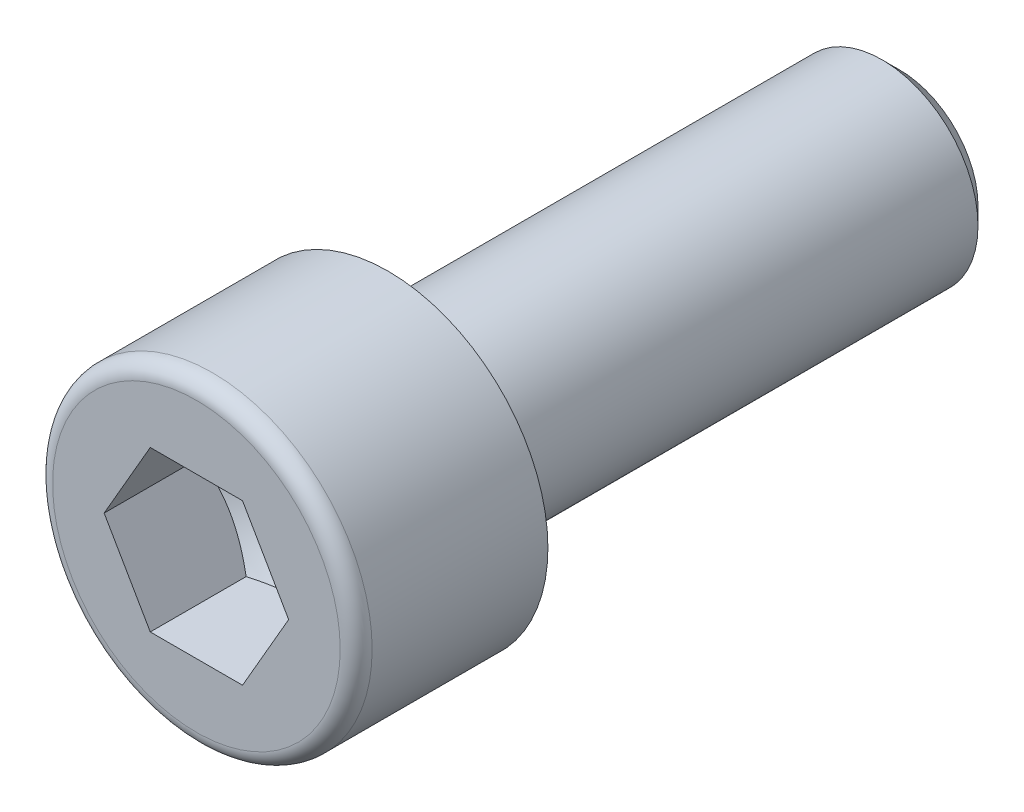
ISO-10303-21;
HEADER;
FILE_DESCRIPTION(('STEP AP214'),'2;1');
FILE_NAME('part.step','',(''),(''),'','','');
FILE_SCHEMA(('AUTOMOTIVE_DESIGN { 1 0 10303 214 1 1 1 1 }'));
ENDSEC;
DATA;
#1=APPLICATION_CONTEXT('core data for automotive mechanical design processes');
#2=APPLICATION_PROTOCOL_DEFINITION('international standard','automotive_design',2000,#1);
#3=PRODUCT_CONTEXT('',#1,'mechanical');
#4=PRODUCT('Part','Part','',(#3));
#5=PRODUCT_RELATED_PRODUCT_CATEGORY('part','',(#4));
#6=PRODUCT_DEFINITION_FORMATION('','',#4);
#7=PRODUCT_DEFINITION_CONTEXT('part definition',#1,'design');
#8=PRODUCT_DEFINITION('design','',#6,#7);
#9=PRODUCT_DEFINITION_SHAPE('','',#8);
#10=(LENGTH_UNIT() NAMED_UNIT(*) SI_UNIT(.MILLI.,.METRE.));
#11=(NAMED_UNIT(*) PLANE_ANGLE_UNIT() SI_UNIT($,.RADIAN.));
#12=(NAMED_UNIT(*) SI_UNIT($,.STERADIAN.) SOLID_ANGLE_UNIT());
#13=UNCERTAINTY_MEASURE_WITH_UNIT(LENGTH_MEASURE(1.E-05),#10,'distance_accuracy_value','');
#14=(GEOMETRIC_REPRESENTATION_CONTEXT(3) GLOBAL_UNCERTAINTY_ASSIGNED_CONTEXT((#13)) GLOBAL_UNIT_ASSIGNED_CONTEXT((#10,
#11,#12)) REPRESENTATION_CONTEXT('',''));
#15=CARTESIAN_POINT('',(0.,0.,0.));
#16=DIRECTION('',(0.,0.,1.));
#17=DIRECTION('',(1.,0.,0.));
#18=AXIS2_PLACEMENT_3D('',#15,#16,#17);
#19=CARTESIAN_POINT('',(0.,0.,6.00000000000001));
#20=DIRECTION('',(0.,0.,0.999999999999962));
#21=DIRECTION('',(0.999999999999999,0.,0.));
#22=AXIS2_PLACEMENT_3D('',#19,#20,#21);
#23=PLANE('',#22);
#24=CARTESIAN_POINT('',(0.,0.,6.00000000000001));
#25=DIRECTION('',(0.,0.,0.999999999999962));
#26=DIRECTION('',(0.999999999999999,0.,0.));
#27=AXIS2_PLACEMENT_3D('',#24,#25,#26);
#28=CIRCLE('',#27,4.5);
#29=CARTESIAN_POINT('',(4.50000000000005,0.,6.00000000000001));
#30=VERTEX_POINT('',#29);
#31=EDGE_CURVE('E11',#30,#30,#28,.T.);
#32=ORIENTED_EDGE('',*,*,#31,.T.);
#33=EDGE_LOOP('',(#32));
#34=FACE_BOUND('',#33,.T.);
#35=DIRECTION('',(1.,0.,0.));
#36=VECTOR('',#35,1.);
#37=CARTESIAN_POINT('',(-1.44337499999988,2.49999883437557,5.99999999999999));
#38=LINE('',#37,#36);
#39=CARTESIAN_POINT('',(-1.44337499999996,2.49999883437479,5.99999999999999));
#40=VERTEX_POINT('',#39);
#41=CARTESIAN_POINT('',(1.44337500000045,2.49999883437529,6.00000000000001));
#42=VERTEX_POINT('',#41);
#43=EDGE_CURVE('E92',#40,#42,#38,.T.);
#44=ORIENTED_EDGE('',*,*,#43,.T.);
#45=DIRECTION('',(0.5,-0.866025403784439,0.));
#46=VECTOR('',#45,1.);
#47=CARTESIAN_POINT('',(1.44337500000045,2.49999883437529,6.00000000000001));
#48=LINE('',#47,#46);
#49=CARTESIAN_POINT('',(2.88675000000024,6.66133814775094E-13,6.00000000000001));
#50=VERTEX_POINT('',#49);
#51=EDGE_CURVE('E31',#42,#50,#48,.T.);
#52=ORIENTED_EDGE('',*,*,#51,.T.);
#53=DIRECTION('',(-0.499999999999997,-0.86602540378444,0.));
#54=VECTOR('',#53,1.);
#55=CARTESIAN_POINT('',(2.88675000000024,6.66133814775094E-13,6.00000000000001));
#56=LINE('',#55,#54);
#57=CARTESIAN_POINT('',(1.44337500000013,-2.49999883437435,6.00000000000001));
#58=VERTEX_POINT('',#57);
#59=EDGE_CURVE('E169',#50,#58,#56,.T.);
#60=ORIENTED_EDGE('',*,*,#59,.T.);
#61=DIRECTION('',(-1.,0.,0.));
#62=VECTOR('',#61,1.);
#63=CARTESIAN_POINT('',(1.44337500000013,-2.49999883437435,6.00000000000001));
#64=LINE('',#63,#62);
#65=CARTESIAN_POINT('',(-1.44337499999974,-2.49999883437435,6.00000000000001));
#66=VERTEX_POINT('',#65);
#67=EDGE_CURVE('E165',#58,#66,#64,.T.);
#68=ORIENTED_EDGE('',*,*,#67,.T.);
#69=DIRECTION('',(-0.5,0.866025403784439,0.));
#70=VECTOR('',#69,1.);
#71=CARTESIAN_POINT('',(-1.44337499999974,-2.49999883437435,6.00000000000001));
#72=LINE('',#71,#70);
#73=CARTESIAN_POINT('',(-2.88674999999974,5.27355936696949E-13,5.99999999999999));
#74=VERTEX_POINT('',#73);
#75=EDGE_CURVE('E160',#66,#74,#72,.T.);
#76=ORIENTED_EDGE('',*,*,#75,.T.);
#77=DIRECTION('',(0.499999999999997,0.86602540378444,0.));
#78=VECTOR('',#77,1.);
#79=CARTESIAN_POINT('',(-2.88674999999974,5.27355936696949E-13,5.99999999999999));
#80=LINE('',#79,#78);
#81=EDGE_CURVE('E96',#74,#40,#80,.T.);
#82=ORIENTED_EDGE('',*,*,#81,.T.);
#83=EDGE_LOOP('',(#44,#52,#60,#68,#76,#82));
#84=FACE_BOUND('',#83,.T.);
#85=ADVANCED_FACE('F17',(#34,#84),#23,.T.);
#86=CARTESIAN_POINT('',(0.,0.,5.50000000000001));
#87=DIRECTION('',(0.,0.,0.999999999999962));
#88=DIRECTION('',(0.999999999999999,0.,0.));
#89=AXIS2_PLACEMENT_3D('',#86,#87,#88);
#90=TOROIDAL_SURFACE('',#89,4.5,0.5);
#91=ORIENTED_EDGE('',*,*,#31,.F.);
#92=EDGE_LOOP('',(#91));
#93=FACE_BOUND('',#92,.T.);
#94=CARTESIAN_POINT('',(0.,0.,5.50000000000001));
#95=DIRECTION('',(0.,0.,0.999999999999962));
#96=DIRECTION('',(0.999999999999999,0.,0.));
#97=AXIS2_PLACEMENT_3D('',#94,#95,#96);
#98=CIRCLE('',#97,5.);
#99=CARTESIAN_POINT('',(5.00000000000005,0.,5.50000000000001));
#100=VERTEX_POINT('',#99);
#101=EDGE_CURVE('E24',#100,#100,#98,.T.);
#102=ORIENTED_EDGE('',*,*,#101,.T.);
#103=EDGE_LOOP('',(#102));
#104=FACE_BOUND('',#103,.T.);
#105=ADVANCED_FACE('F133',(#93,#104),#90,.T.);
#106=CARTESIAN_POINT('',(0.,0.,6.00000000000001));
#107=DIRECTION('',(0.,0.,0.999999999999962));
#108=DIRECTION('',(0.999999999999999,0.,0.));
#109=AXIS2_PLACEMENT_3D('',#106,#107,#108);
#110=CYLINDRICAL_SURFACE('',#109,5.);
#111=CARTESIAN_POINT('',(0.,0.,0.));
#112=DIRECTION('',(0.,0.,0.999999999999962));
#113=DIRECTION('',(0.999999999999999,0.,0.));
#114=AXIS2_PLACEMENT_3D('',#111,#112,#113);
#115=CIRCLE('',#114,5.);
#116=CARTESIAN_POINT('',(5.00000000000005,0.,0.));
#117=VERTEX_POINT('',#116);
#118=EDGE_CURVE('E128',#117,#117,#115,.T.);
#119=CARTESIAN_POINT('',(5.00000000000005,0.,0.));
#120=CARTESIAN_POINT('',(5.00000000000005,0.,0.057291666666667));
#121=CARTESIAN_POINT('',(5.00000000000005,0.,0.114583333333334));
#122=CARTESIAN_POINT('',(5.00000000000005,0.,0.229166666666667));
#123=CARTESIAN_POINT('',(5.00000000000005,0.,0.286458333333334));
#124=CARTESIAN_POINT('',(5.00000000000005,0.,0.401041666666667));
#125=CARTESIAN_POINT('',(5.00000000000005,0.,0.458333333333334));
#126=CARTESIAN_POINT('',(5.00000000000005,0.,0.572916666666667));
#127=CARTESIAN_POINT('',(5.00000000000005,0.,0.630208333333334));
#128=CARTESIAN_POINT('',(5.00000000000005,0.,0.744791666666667));
#129=CARTESIAN_POINT('',(5.00000000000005,0.,0.802083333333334));
#130=CARTESIAN_POINT('',(5.00000000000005,0.,0.916666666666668));
#131=CARTESIAN_POINT('',(5.00000000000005,0.,0.973958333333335));
#132=CARTESIAN_POINT('',(5.00000000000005,0.,1.08854166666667));
#133=CARTESIAN_POINT('',(5.00000000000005,0.,1.14583333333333));
#134=CARTESIAN_POINT('',(5.00000000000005,0.,1.26041666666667));
#135=CARTESIAN_POINT('',(5.00000000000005,0.,1.31770833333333));
#136=CARTESIAN_POINT('',(5.00000000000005,0.,1.43229166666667));
#137=CARTESIAN_POINT('',(5.00000000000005,0.,1.48958333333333));
#138=CARTESIAN_POINT('',(5.00000000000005,0.,1.60416666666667));
#139=CARTESIAN_POINT('',(5.00000000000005,0.,1.66145833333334));
#140=CARTESIAN_POINT('',(5.00000000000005,0.,1.77604166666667));
#141=CARTESIAN_POINT('',(5.00000000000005,0.,1.83333333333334));
#142=CARTESIAN_POINT('',(5.00000000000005,0.,1.94791666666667));
#143=CARTESIAN_POINT('',(5.00000000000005,0.,2.00520833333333));
#144=CARTESIAN_POINT('',(5.00000000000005,0.,2.11979166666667));
#145=CARTESIAN_POINT('',(5.00000000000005,0.,2.17708333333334));
#146=CARTESIAN_POINT('',(5.00000000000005,0.,2.29166666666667));
#147=CARTESIAN_POINT('',(5.00000000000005,0.,2.34895833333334));
#148=CARTESIAN_POINT('',(5.00000000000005,0.,2.46354166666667));
#149=CARTESIAN_POINT('',(5.00000000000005,0.,2.52083333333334));
#150=CARTESIAN_POINT('',(5.00000000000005,0.,2.63541666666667));
#151=CARTESIAN_POINT('',(5.00000000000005,0.,2.69270833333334));
#152=CARTESIAN_POINT('',(5.00000000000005,0.,2.80729166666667));
#153=CARTESIAN_POINT('',(5.00000000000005,0.,2.86458333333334));
#154=CARTESIAN_POINT('',(5.00000000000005,0.,2.97916666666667));
#155=CARTESIAN_POINT('',(5.00000000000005,0.,3.03645833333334));
#156=CARTESIAN_POINT('',(5.00000000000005,0.,3.15104166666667));
#157=CARTESIAN_POINT('',(5.00000000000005,0.,3.20833333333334));
#158=CARTESIAN_POINT('',(5.00000000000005,0.,3.32291666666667));
#159=CARTESIAN_POINT('',(5.00000000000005,0.,3.38020833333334));
#160=CARTESIAN_POINT('',(5.00000000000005,0.,3.49479166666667));
#161=CARTESIAN_POINT('',(5.00000000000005,0.,3.55208333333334));
#162=CARTESIAN_POINT('',(5.00000000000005,0.,3.66666666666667));
#163=CARTESIAN_POINT('',(5.00000000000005,0.,3.72395833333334));
#164=CARTESIAN_POINT('',(5.00000000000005,0.,3.83854166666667));
#165=CARTESIAN_POINT('',(5.00000000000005,0.,3.89583333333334));
#166=CARTESIAN_POINT('',(5.00000000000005,0.,4.01041666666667));
#167=CARTESIAN_POINT('',(5.00000000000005,0.,4.06770833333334));
#168=CARTESIAN_POINT('',(5.00000000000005,0.,4.18229166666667));
#169=CARTESIAN_POINT('',(5.00000000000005,0.,4.23958333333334));
#170=CARTESIAN_POINT('',(5.00000000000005,0.,4.35416666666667));
#171=CARTESIAN_POINT('',(5.00000000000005,0.,4.41145833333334));
#172=CARTESIAN_POINT('',(5.00000000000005,0.,4.52604166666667));
#173=CARTESIAN_POINT('',(5.00000000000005,0.,4.58333333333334));
#174=CARTESIAN_POINT('',(5.00000000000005,0.,4.69791666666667));
#175=CARTESIAN_POINT('',(5.00000000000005,0.,4.75520833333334));
#176=CARTESIAN_POINT('',(5.00000000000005,0.,4.86979166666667));
#177=CARTESIAN_POINT('',(5.00000000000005,0.,4.92708333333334));
#178=CARTESIAN_POINT('',(5.00000000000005,0.,5.04166666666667));
#179=CARTESIAN_POINT('',(5.00000000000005,0.,5.09895833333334));
#180=CARTESIAN_POINT('',(5.00000000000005,0.,5.21354166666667));
#181=CARTESIAN_POINT('',(5.00000000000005,0.,5.27083333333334));
#182=CARTESIAN_POINT('',(5.00000000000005,0.,5.38541666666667));
#183=CARTESIAN_POINT('',(5.00000000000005,0.,5.44270833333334));
#184=CARTESIAN_POINT('',(5.00000000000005,0.,5.50000000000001));
#185=B_SPLINE_CURVE_WITH_KNOTS('',3,(#119,#120,#121,#122,#123,#124,#125,#126,#127,#128,#129,
#130,#131,#132,#133,#134,#135,#136,#137,#138,#139,#140,#141,#142,#143,#144,#145,#146,#147,#148,
#149,#150,#151,#152,#153,#154,#155,#156,#157,#158,#159,#160,#161,#162,#163,#164,#165,#166,#167,
#168,#169,#170,#171,#172,#173,#174,#175,#176,#177,#178,#179,#180,#181,#182,#183,#184),
.UNSPECIFIED.,.F.,.F.,(4,2,2,2,2,2,2,2,2,2,2,2,2,2,2,2,2,2,2,2,2,2,2,2,2,2,2,2,2,2,2,2,4),(0.,
0.171875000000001,0.34375,0.515625,0.687500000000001,0.859375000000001,1.03125,1.203125,1.375,
1.546875,1.71875,1.890625,2.0625,2.234375,2.40625,2.578125,2.75,2.921875,3.09375,3.265625,
3.4375,3.609375,3.78125,3.953125,4.125,4.296875,4.46875,4.640625,4.8125,4.984375,5.15625,
5.328125,5.50000000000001),.UNSPECIFIED.);
#186=EDGE_CURVE('BSEAM135',#117,#100,#185,.T.);
#187=ORIENTED_EDGE('',*,*,#118,.T.);
#188=ORIENTED_EDGE('',*,*,#101,.F.);
#189=ORIENTED_EDGE('',*,*,#186,.T.);
#190=ORIENTED_EDGE('',*,*,#186,.F.);
#191=EDGE_LOOP('',(#187,#189,#188,#190));
#192=FACE_BOUND('',#191,.T.);
#193=ADVANCED_FACE('F135',(#192),#110,.T.);
#194=CARTESIAN_POINT('',(0.,5.,0.));
#195=DIRECTION('',(0.,0.,-0.999999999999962));
#196=DIRECTION('',(-0.999999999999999,0.,0.));
#197=AXIS2_PLACEMENT_3D('',#194,#195,#196);
#198=PLANE('',#197);
#199=CARTESIAN_POINT('',(0.,0.,0.));
#200=DIRECTION('',(0.,0.,0.999999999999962));
#201=DIRECTION('',(0.999999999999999,0.,0.));
#202=AXIS2_PLACEMENT_3D('',#199,#200,#201);
#203=CIRCLE('',#202,3.3);
#204=CARTESIAN_POINT('',(3.29999999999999,0.,0.));
#205=VERTEX_POINT('',#204);
#206=EDGE_CURVE('E125',#205,#205,#203,.T.);
#207=ORIENTED_EDGE('',*,*,#206,.T.);
#208=EDGE_LOOP('',(#207));
#209=FACE_BOUND('',#208,.T.);
#210=ORIENTED_EDGE('',*,*,#118,.F.);
#211=EDGE_LOOP('',(#210));
#212=FACE_BOUND('',#211,.T.);
#213=ADVANCED_FACE('F137',(#209,#212),#198,.T.);
#214=CARTESIAN_POINT('',(0.,0.,-0.300000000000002));
#215=DIRECTION('',(0.,0.,0.999999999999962));
#216=DIRECTION('',(0.999999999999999,0.,0.));
#217=AXIS2_PLACEMENT_3D('',#214,#215,#216);
#218=TOROIDAL_SURFACE('',#217,3.3,0.3);
#219=CARTESIAN_POINT('',(0.,0.,-0.300000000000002));
#220=DIRECTION('',(0.,0.,0.999999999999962));
#221=DIRECTION('',(0.999999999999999,0.,0.));
#222=AXIS2_PLACEMENT_3D('',#219,#220,#221);
#223=CIRCLE('',#222,3.);
#224=CARTESIAN_POINT('',(3.00000000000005,0.,-0.300000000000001));
#225=VERTEX_POINT('',#224);
#226=EDGE_CURVE('E122',#225,#225,#223,.T.);
#227=ORIENTED_EDGE('',*,*,#226,.T.);
#228=EDGE_LOOP('',(#227));
#229=FACE_BOUND('',#228,.T.);
#230=ORIENTED_EDGE('',*,*,#206,.F.);
#231=EDGE_LOOP('',(#230));
#232=FACE_BOUND('',#231,.T.);
#233=ADVANCED_FACE('F145',(#229,#232),#218,.F.);
#234=CARTESIAN_POINT('',(0.,0.,6.00000000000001));
#235=DIRECTION('',(0.,0.,0.999999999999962));
#236=DIRECTION('',(0.999999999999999,0.,0.));
#237=AXIS2_PLACEMENT_3D('',#234,#235,#236);
#238=CYLINDRICAL_SURFACE('',#237,3.);
#239=CARTESIAN_POINT('',(0.,0.,-0.301000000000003));
#240=DIRECTION('',(0.,0.,0.999999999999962));
#241=DIRECTION('',(0.999999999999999,0.,0.));
#242=AXIS2_PLACEMENT_3D('',#239,#240,#241);
#243=CIRCLE('',#242,3.);
#244=CARTESIAN_POINT('',(3.00000000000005,0.,-0.301000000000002));
#245=VERTEX_POINT('',#244);
#246=EDGE_CURVE('E119',#245,#245,#243,.T.);
#247=CARTESIAN_POINT('',(3.00000000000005,0.,-0.301000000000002));
#248=CARTESIAN_POINT('',(3.00000000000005,0.,-0.300989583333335));
#249=CARTESIAN_POINT('',(3.00000000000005,0.,-0.300979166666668));
#250=CARTESIAN_POINT('',(3.00000000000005,0.,-0.300958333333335));
#251=CARTESIAN_POINT('',(3.00000000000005,0.,-0.300947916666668));
#252=CARTESIAN_POINT('',(3.00000000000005,0.,-0.300927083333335));
#253=CARTESIAN_POINT('',(3.00000000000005,0.,-0.300916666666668));
#254=CARTESIAN_POINT('',(3.00000000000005,0.,-0.300895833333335));
#255=CARTESIAN_POINT('',(3.00000000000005,0.,-0.300885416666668));
#256=CARTESIAN_POINT('',(3.00000000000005,0.,-0.300864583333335));
#257=CARTESIAN_POINT('',(3.00000000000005,0.,-0.300854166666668));
#258=CARTESIAN_POINT('',(3.00000000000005,0.,-0.300833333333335));
#259=CARTESIAN_POINT('',(3.00000000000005,0.,-0.300822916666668));
#260=CARTESIAN_POINT('',(3.00000000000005,0.,-0.300802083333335));
#261=CARTESIAN_POINT('',(3.00000000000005,0.,-0.300791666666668));
#262=CARTESIAN_POINT('',(3.00000000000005,0.,-0.300770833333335));
#263=CARTESIAN_POINT('',(3.00000000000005,0.,-0.300760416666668));
#264=CARTESIAN_POINT('',(3.00000000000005,0.,-0.300739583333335));
#265=CARTESIAN_POINT('',(3.00000000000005,0.,-0.300729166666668));
#266=CARTESIAN_POINT('',(3.00000000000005,0.,-0.300708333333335));
#267=CARTESIAN_POINT('',(3.00000000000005,0.,-0.300697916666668));
#268=CARTESIAN_POINT('',(3.00000000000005,0.,-0.300677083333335));
#269=CARTESIAN_POINT('',(3.00000000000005,0.,-0.300666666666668));
#270=CARTESIAN_POINT('',(3.00000000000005,0.,-0.300645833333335));
#271=CARTESIAN_POINT('',(3.00000000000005,0.,-0.300635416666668));
#272=CARTESIAN_POINT('',(3.00000000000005,0.,-0.300614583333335));
#273=CARTESIAN_POINT('',(3.00000000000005,0.,-0.300604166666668));
#274=CARTESIAN_POINT('',(3.00000000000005,0.,-0.300583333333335));
#275=CARTESIAN_POINT('',(3.00000000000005,0.,-0.300572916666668));
#276=CARTESIAN_POINT('',(3.00000000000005,0.,-0.300552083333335));
#277=CARTESIAN_POINT('',(3.00000000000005,0.,-0.300541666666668));
#278=CARTESIAN_POINT('',(3.00000000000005,0.,-0.300520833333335));
#279=CARTESIAN_POINT('',(3.00000000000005,0.,-0.300510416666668));
#280=CARTESIAN_POINT('',(3.00000000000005,0.,-0.300489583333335));
#281=CARTESIAN_POINT('',(3.00000000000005,0.,-0.300479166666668));
#282=CARTESIAN_POINT('',(3.00000000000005,0.,-0.300458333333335));
#283=CARTESIAN_POINT('',(3.00000000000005,0.,-0.300447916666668));
#284=CARTESIAN_POINT('',(3.00000000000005,0.,-0.300427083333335));
#285=CARTESIAN_POINT('',(3.00000000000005,0.,-0.300416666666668));
#286=CARTESIAN_POINT('',(3.00000000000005,0.,-0.300395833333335));
#287=CARTESIAN_POINT('',(3.00000000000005,0.,-0.300385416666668));
#288=CARTESIAN_POINT('',(3.00000000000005,0.,-0.300364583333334));
#289=CARTESIAN_POINT('',(3.00000000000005,0.,-0.300354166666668));
#290=CARTESIAN_POINT('',(3.00000000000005,0.,-0.300333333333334));
#291=CARTESIAN_POINT('',(3.00000000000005,0.,-0.300322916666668));
#292=CARTESIAN_POINT('',(3.00000000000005,0.,-0.300302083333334));
#293=CARTESIAN_POINT('',(3.00000000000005,0.,-0.300291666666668));
#294=CARTESIAN_POINT('',(3.00000000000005,0.,-0.300270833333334));
#295=CARTESIAN_POINT('',(3.00000000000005,0.,-0.300260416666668));
#296=CARTESIAN_POINT('',(3.00000000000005,0.,-0.300239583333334));
#297=CARTESIAN_POINT('',(3.00000000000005,0.,-0.300229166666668));
#298=CARTESIAN_POINT('',(3.00000000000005,0.,-0.300208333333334));
#299=CARTESIAN_POINT('',(3.00000000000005,0.,-0.300197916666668));
#300=CARTESIAN_POINT('',(3.00000000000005,0.,-0.300177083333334));
#301=CARTESIAN_POINT('',(3.00000000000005,0.,-0.300166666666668));
#302=CARTESIAN_POINT('',(3.00000000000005,0.,-0.300145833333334));
#303=CARTESIAN_POINT('',(3.00000000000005,0.,-0.300135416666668));
#304=CARTESIAN_POINT('',(3.00000000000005,0.,-0.300114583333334));
#305=CARTESIAN_POINT('',(3.00000000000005,0.,-0.300104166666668));
#306=CARTESIAN_POINT('',(3.00000000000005,0.,-0.300083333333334));
#307=CARTESIAN_POINT('',(3.00000000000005,0.,-0.300072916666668));
#308=CARTESIAN_POINT('',(3.00000000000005,0.,-0.300052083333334));
#309=CARTESIAN_POINT('',(3.00000000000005,0.,-0.300041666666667));
#310=CARTESIAN_POINT('',(3.00000000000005,0.,-0.300020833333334));
#311=CARTESIAN_POINT('',(3.00000000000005,0.,-0.300010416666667));
#312=CARTESIAN_POINT('',(3.00000000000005,0.,-0.300000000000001));
#313=B_SPLINE_CURVE_WITH_KNOTS('',3,(#247,#248,#249,#250,#251,#252,#253,#254,#255,#256,#257,
#258,#259,#260,#261,#262,#263,#264,#265,#266,#267,#268,#269,#270,#271,#272,#273,#274,#275,#276,
#277,#278,#279,#280,#281,#282,#283,#284,#285,#286,#287,#288,#289,#290,#291,#292,#293,#294,#295,
#296,#297,#298,#299,#300,#301,#302,#303,#304,#305,#306,#307,#308,#309,#310,#311,#312),
.UNSPECIFIED.,.F.,.F.,(4,2,2,2,2,2,2,2,2,2,2,2,2,2,2,2,2,2,2,2,2,2,2,2,2,2,2,2,2,2,2,2,4),(0.,
3.12500000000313E-05,6.25000000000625E-05,9.37500000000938E-05,0.000125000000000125,
0.000156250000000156,0.000187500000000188,0.000218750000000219,0.00025000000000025,
0.000281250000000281,0.000312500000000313,0.000343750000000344,0.000375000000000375,
0.000406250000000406,0.000437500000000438,0.000468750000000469,0.0005000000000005,
0.000531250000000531,0.000562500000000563,0.000593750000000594,0.000625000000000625,
0.000656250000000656,0.000687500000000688,0.000718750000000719,0.00075000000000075,
0.000781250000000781,0.000812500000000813,0.000843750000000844,0.000875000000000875,
0.000906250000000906,0.000937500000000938,0.000968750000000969,0.001000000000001),.UNSPECIFIED.);
#314=EDGE_CURVE('BSEAM268',#245,#225,#313,.T.);
#315=ORIENTED_EDGE('',*,*,#246,.T.);
#316=ORIENTED_EDGE('',*,*,#226,.F.);
#317=ORIENTED_EDGE('',*,*,#314,.T.);
#318=ORIENTED_EDGE('',*,*,#314,.F.);
#319=EDGE_LOOP('',(#315,#317,#316,#318));
#320=FACE_BOUND('',#319,.T.);
#321=ADVANCED_FACE('F268',(#320),#238,.T.);
#322=CARTESIAN_POINT('',(0.,0.,-0.301000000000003));
#323=DIRECTION('',(0.,0.,0.999999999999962));
#324=DIRECTION('',(0.999999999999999,0.,0.));
#325=AXIS2_PLACEMENT_3D('',#322,#323,#324);
#326=CONICAL_SURFACE('',#325,3.,0.523598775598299);
#327=CARTESIAN_POINT('',(1.45716771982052E-13,2.16493489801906E-12,-1.23847249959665));
#328=DIRECTION('',(0.,0.,0.999999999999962));
#329=DIRECTION('',(0.999999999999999,0.,0.));
#330=AXIS2_PLACEMENT_3D('',#327,#328,#329);
#331=CIRCLE('',#330,2.45875);
#332=CARTESIAN_POINT('',(2.45874999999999,0.,-1.23847249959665));
#333=VERTEX_POINT('',#332);
#334=EDGE_CURVE('E116',#333,#333,#331,.T.);
#335=CARTESIAN_POINT('',(2.45874999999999,0.,-1.23847249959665));
#336=CARTESIAN_POINT('',(2.46438802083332,0.,-1.22870716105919));
#337=CARTESIAN_POINT('',(2.47002604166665,0.,-1.21894182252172));
#338=CARTESIAN_POINT('',(2.48130208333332,0.,-1.19941114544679));
#339=CARTESIAN_POINT('',(2.48694010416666,0.,-1.18964580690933));
#340=CARTESIAN_POINT('',(2.49821614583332,0.,-1.1701151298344));
#341=CARTESIAN_POINT('',(2.50385416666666,0.,-1.16034979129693));
#342=CARTESIAN_POINT('',(2.51513020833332,0.,-1.140819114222));
#343=CARTESIAN_POINT('',(2.52076822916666,0.,-1.13105377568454));
#344=CARTESIAN_POINT('',(2.53204427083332,0.,-1.11152309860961));
#345=CARTESIAN_POINT('',(2.53768229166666,0.,-1.10175776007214));
#346=CARTESIAN_POINT('',(2.54895833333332,0.,-1.08222708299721));
#347=CARTESIAN_POINT('',(2.55459635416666,0.,-1.07246174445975));
#348=CARTESIAN_POINT('',(2.56587239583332,0.,-1.05293106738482));
#349=CARTESIAN_POINT('',(2.57151041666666,0.,-1.04316572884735));
#350=CARTESIAN_POINT('',(2.58278645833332,0.,-1.02363505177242));
#351=CARTESIAN_POINT('',(2.58842447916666,0.,-1.01386971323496));
#352=CARTESIAN_POINT('',(2.59970052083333,0.,-0.994339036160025));
#353=CARTESIAN_POINT('',(2.60533854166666,0.,-0.98457369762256));
#354=CARTESIAN_POINT('',(2.61661458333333,0.,-0.96504302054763));
#355=CARTESIAN_POINT('',(2.62225260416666,0.,-0.955277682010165));
#356=CARTESIAN_POINT('',(2.63352864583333,0.,-0.935747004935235));
#357=CARTESIAN_POINT('',(2.63916666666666,0.,-0.925981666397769));
#358=CARTESIAN_POINT('',(2.65044270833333,0.,-0.906450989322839));
#359=CARTESIAN_POINT('',(2.65608072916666,0.,-0.896685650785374));
#360=CARTESIAN_POINT('',(2.66735677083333,0.,-0.877154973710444));
#361=CARTESIAN_POINT('',(2.67299479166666,0.,-0.867389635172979));
#362=CARTESIAN_POINT('',(2.68427083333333,0.,-0.847858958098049));
#363=CARTESIAN_POINT('',(2.68990885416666,0.,-0.838093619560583));
#364=CARTESIAN_POINT('',(2.70118489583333,0.,-0.818562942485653));
#365=CARTESIAN_POINT('',(2.70682291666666,0.,-0.808797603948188));
#366=CARTESIAN_POINT('',(2.71809895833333,0.,-0.789266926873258));
#367=CARTESIAN_POINT('',(2.72373697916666,0.,-0.779501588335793));
#368=CARTESIAN_POINT('',(2.73501302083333,0.,-0.759970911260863));
#369=CARTESIAN_POINT('',(2.74065104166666,0.,-0.750205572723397));
#370=CARTESIAN_POINT('',(2.75192708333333,0.,-0.730674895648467));
#371=CARTESIAN_POINT('',(2.75756510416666,0.,-0.720909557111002));
#372=CARTESIAN_POINT('',(2.76884114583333,0.,-0.701378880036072));
#373=CARTESIAN_POINT('',(2.77447916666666,0.,-0.691613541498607));
#374=CARTESIAN_POINT('',(2.78575520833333,0.,-0.672082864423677));
#375=CARTESIAN_POINT('',(2.79139322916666,0.,-0.662317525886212));
#376=CARTESIAN_POINT('',(2.80266927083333,0.,-0.642786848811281));
#377=CARTESIAN_POINT('',(2.80830729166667,0.,-0.633021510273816));
#378=CARTESIAN_POINT('',(2.81958333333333,0.,-0.613490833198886));
#379=CARTESIAN_POINT('',(2.82522135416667,0.,-0.603725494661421));
#380=CARTESIAN_POINT('',(2.83649739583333,0.,-0.584194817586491));
#381=CARTESIAN_POINT('',(2.84213541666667,0.,-0.574429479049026));
#382=CARTESIAN_POINT('',(2.85341145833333,0.,-0.554898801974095));
#383=CARTESIAN_POINT('',(2.85904947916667,0.,-0.54513346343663));
#384=CARTESIAN_POINT('',(2.87032552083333,0.,-0.5256027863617));
#385=CARTESIAN_POINT('',(2.87596354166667,0.,-0.515837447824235));
#386=CARTESIAN_POINT('',(2.88723958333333,0.,-0.496306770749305));
#387=CARTESIAN_POINT('',(2.89287760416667,0.,-0.486541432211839));
#388=CARTESIAN_POINT('',(2.90415364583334,0.,-0.467010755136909));
#389=CARTESIAN_POINT('',(2.90979166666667,0.,-0.457245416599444));
#390=CARTESIAN_POINT('',(2.92106770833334,0.,-0.437714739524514));
#391=CARTESIAN_POINT('',(2.92670572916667,0.,-0.427949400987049));
#392=CARTESIAN_POINT('',(2.93798177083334,0.,-0.408418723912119));
#393=CARTESIAN_POINT('',(2.94361979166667,0.,-0.398653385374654));
#394=CARTESIAN_POINT('',(2.95489583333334,0.,-0.379122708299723));
#395=CARTESIAN_POINT('',(2.96053385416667,0.,-0.369357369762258));
#396=CARTESIAN_POINT('',(2.97180989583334,0.,-0.349826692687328));
#397=CARTESIAN_POINT('',(2.97744791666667,0.,-0.340061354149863));
#398=CARTESIAN_POINT('',(2.98872395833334,0.,-0.320530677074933));
#399=CARTESIAN_POINT('',(2.99436197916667,0.,-0.310765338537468));
#400=CARTESIAN_POINT('',(3.,0.,-0.301000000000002));
#401=B_SPLINE_CURVE_WITH_KNOTS('',3,(#335,#336,#337,#338,#339,#340,#341,#342,#343,#344,#345,
#346,#347,#348,#349,#350,#351,#352,#353,#354,#355,#356,#357,#358,#359,#360,#361,#362,#363,#364,
#365,#366,#367,#368,#369,#370,#371,#372,#373,#374,#375,#376,#377,#378,#379,#380,#381,#382,#383,
#384,#385,#386,#387,#388,#389,#390,#391,#392,#393,#394,#395,#396,#397,#398,#399,#400),
.UNSPECIFIED.,.F.,.F.,(4,2,2,2,2,2,2,2,2,2,2,2,2,2,2,2,2,2,2,2,2,2,2,2,2,2,2,2,2,2,2,2,4),(0.,
0.033828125,0.0676562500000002,0.101484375,0.135312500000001,0.169140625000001,
0.202968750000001,0.236796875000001,0.270625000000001,0.304453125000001,0.338281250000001,
0.372109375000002,0.405937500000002,0.439765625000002,0.473593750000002,0.507421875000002,
0.541250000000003,0.575078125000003,0.608906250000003,0.642734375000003,0.676562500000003,
0.710390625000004,0.744218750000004,0.778046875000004,0.811875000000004,0.845703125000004,
0.879531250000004,0.913359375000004,0.947187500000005,0.981015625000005,1.01484375,1.048671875,
1.08250000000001),.UNSPECIFIED.);
#402=EDGE_CURVE('BSEAM264',#333,#245,#401,.T.);
#403=ORIENTED_EDGE('',*,*,#334,.T.);
#404=ORIENTED_EDGE('',*,*,#246,.F.);
#405=ORIENTED_EDGE('',*,*,#402,.T.);
#406=ORIENTED_EDGE('',*,*,#402,.F.);
#407=EDGE_LOOP('',(#403,#405,#404,#406));
#408=FACE_BOUND('',#407,.T.);
#409=ADVANCED_FACE('F264',(#408),#326,.T.);
#410=CARTESIAN_POINT('',(4.78783679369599E-13,2.45875000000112,-1.23847249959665));
#411=DIRECTION('',(0.,0.,0.999999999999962));
#412=DIRECTION('',(0.999999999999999,0.,0.));
#413=AXIS2_PLACEMENT_3D('',#410,#411,#412);
#414=PLANE('',#413);
#415=CARTESIAN_POINT('',(1.45716771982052E-13,2.16493489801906E-12,-1.23847249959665));
#416=DIRECTION('',(0.,0.,0.999999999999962));
#417=DIRECTION('',(0.999999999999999,0.,0.));
#418=AXIS2_PLACEMENT_3D('',#415,#416,#417);
#419=CIRCLE('',#418,3.);
#420=CARTESIAN_POINT('',(3.00000000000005,0.,-1.23847249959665));
#421=VERTEX_POINT('',#420);
#422=EDGE_CURVE('E113',#421,#421,#419,.T.);
#423=ORIENTED_EDGE('',*,*,#422,.T.);
#424=EDGE_LOOP('',(#423));
#425=FACE_BOUND('',#424,.T.);
#426=ORIENTED_EDGE('',*,*,#334,.F.);
#427=EDGE_LOOP('',(#426));
#428=FACE_BOUND('',#427,.T.);
#429=ADVANCED_FACE('F260',(#425,#428),#414,.T.);
#430=CARTESIAN_POINT('',(0.,0.,6.00000000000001));
#431=DIRECTION('',(0.,0.,0.999999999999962));
#432=DIRECTION('',(0.999999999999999,0.,0.));
#433=AXIS2_PLACEMENT_3D('',#430,#431,#432);
#434=CYLINDRICAL_SURFACE('',#433,3.);
#435=CARTESIAN_POINT('',(0.,1.66533453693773E-13,-15.45875));
#436=DIRECTION('',(0.,0.,0.999999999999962));
#437=DIRECTION('',(0.999999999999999,0.,0.));
#438=AXIS2_PLACEMENT_3D('',#435,#436,#437);
#439=CIRCLE('',#438,3.);
#440=CARTESIAN_POINT('',(3.00000000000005,0.,-15.45875));
#441=VERTEX_POINT('',#440);
#442=EDGE_CURVE('E110',#441,#441,#439,.T.);
#443=CARTESIAN_POINT('',(3.00000000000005,0.,-15.45875));
#444=CARTESIAN_POINT('',(3.00000000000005,0.,-15.3106221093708));
#445=CARTESIAN_POINT('',(3.00000000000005,0.,-15.1624942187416));
#446=CARTESIAN_POINT('',(3.00000000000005,0.,-14.8662384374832));
#447=CARTESIAN_POINT('',(3.00000000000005,0.,-14.718110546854));
#448=CARTESIAN_POINT('',(3.00000000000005,0.,-14.4218547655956));
#449=CARTESIAN_POINT('',(3.00000000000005,0.,-14.2737268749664));
#450=CARTESIAN_POINT('',(3.00000000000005,0.,-13.977471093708));
#451=CARTESIAN_POINT('',(3.00000000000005,0.,-13.8293432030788));
#452=CARTESIAN_POINT('',(3.00000000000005,0.,-13.5330874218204));
#453=CARTESIAN_POINT('',(3.00000000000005,0.,-13.3849595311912));
#454=CARTESIAN_POINT('',(3.00000000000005,0.,-13.0887037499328));
#455=CARTESIAN_POINT('',(3.00000000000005,0.,-12.9405758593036));
#456=CARTESIAN_POINT('',(3.00000000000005,0.,-12.6443200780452));
#457=CARTESIAN_POINT('',(3.00000000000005,0.,-12.496192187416));
#458=CARTESIAN_POINT('',(3.00000000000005,0.,-12.1999364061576));
#459=CARTESIAN_POINT('',(3.00000000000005,0.,-12.0518085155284));
#460=CARTESIAN_POINT('',(3.00000000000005,0.,-11.75555273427));
#461=CARTESIAN_POINT('',(3.00000000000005,0.,-11.6074248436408));
#462=CARTESIAN_POINT('',(3.00000000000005,0.,-11.3111690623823));
#463=CARTESIAN_POINT('',(3.00000000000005,0.,-11.1630411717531));
#464=CARTESIAN_POINT('',(3.00000000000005,0.,-10.8667853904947));
#465=CARTESIAN_POINT('',(3.00000000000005,0.,-10.7186574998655));
#466=CARTESIAN_POINT('',(3.00000000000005,0.,-10.4224017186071));
#467=CARTESIAN_POINT('',(3.00000000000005,0.,-10.2742738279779));
#468=CARTESIAN_POINT('',(3.00000000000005,0.,-9.97801804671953));
#469=CARTESIAN_POINT('',(3.00000000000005,0.,-9.82989015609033));
#470=CARTESIAN_POINT('',(3.00000000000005,0.,-9.53363437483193));
#471=CARTESIAN_POINT('',(3.00000000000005,0.,-9.38550648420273));
#472=CARTESIAN_POINT('',(3.00000000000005,0.,-9.08925070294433));
#473=CARTESIAN_POINT('',(3.00000000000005,0.,-8.94112281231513));
#474=CARTESIAN_POINT('',(3.00000000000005,0.,-8.64486703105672));
#475=CARTESIAN_POINT('',(3.00000000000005,0.,-8.49673914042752));
#476=CARTESIAN_POINT('',(3.00000000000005,0.,-8.20048335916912));
#477=CARTESIAN_POINT('',(3.00000000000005,0.,-8.05235546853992));
#478=CARTESIAN_POINT('',(3.00000000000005,0.,-7.75609968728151));
#479=CARTESIAN_POINT('',(3.00000000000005,0.,-7.60797179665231));
#480=CARTESIAN_POINT('',(3.00000000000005,0.,-7.31171601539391));
#481=CARTESIAN_POINT('',(3.00000000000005,0.,-7.16358812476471));
#482=CARTESIAN_POINT('',(3.00000000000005,0.,-6.8673323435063));
#483=CARTESIAN_POINT('',(3.00000000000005,0.,-6.7192044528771));
#484=CARTESIAN_POINT('',(3.00000000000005,0.,-6.4229486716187));
#485=CARTESIAN_POINT('',(3.00000000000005,0.,-6.2748207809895));
#486=CARTESIAN_POINT('',(3.00000000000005,0.,-5.9785649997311));
#487=CARTESIAN_POINT('',(3.00000000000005,0.,-5.8304371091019));
#488=CARTESIAN_POINT('',(3.00000000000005,0.,-5.53418132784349));
#489=CARTESIAN_POINT('',(3.00000000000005,0.,-5.38605343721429));
#490=CARTESIAN_POINT('',(3.00000000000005,0.,-5.08979765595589));
#491=CARTESIAN_POINT('',(3.00000000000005,0.,-4.94166976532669));
#492=CARTESIAN_POINT('',(3.00000000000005,0.,-4.64541398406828));
#493=CARTESIAN_POINT('',(3.00000000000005,0.,-4.49728609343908));
#494=CARTESIAN_POINT('',(3.00000000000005,0.,-4.20103031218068));
#495=CARTESIAN_POINT('',(3.00000000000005,0.,-4.05290242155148));
#496=CARTESIAN_POINT('',(3.00000000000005,0.,-3.75664664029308));
#497=CARTESIAN_POINT('',(3.00000000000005,0.,-3.60851874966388));
#498=CARTESIAN_POINT('',(3.00000000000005,0.,-3.31226296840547));
#499=CARTESIAN_POINT('',(3.00000000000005,0.,-3.16413507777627));
#500=CARTESIAN_POINT('',(3.00000000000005,0.,-2.86787929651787));
#501=CARTESIAN_POINT('',(3.00000000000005,0.,-2.71975140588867));
#502=CARTESIAN_POINT('',(3.00000000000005,0.,-2.42349562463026));
#503=CARTESIAN_POINT('',(3.00000000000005,0.,-2.27536773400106));
#504=CARTESIAN_POINT('',(3.00000000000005,0.,-1.97911195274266));
#505=CARTESIAN_POINT('',(3.00000000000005,0.,-1.83098406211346));
#506=CARTESIAN_POINT('',(3.00000000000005,0.,-1.53472828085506));
#507=CARTESIAN_POINT('',(3.00000000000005,0.,-1.38660039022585));
#508=CARTESIAN_POINT('',(3.00000000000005,0.,-1.23847249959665));
#509=B_SPLINE_CURVE_WITH_KNOTS('',3,(#443,#444,#445,#446,#447,#448,#449,#450,#451,#452,#453,
#454,#455,#456,#457,#458,#459,#460,#461,#462,#463,#464,#465,#466,#467,#468,#469,#470,#471,#472,
#473,#474,#475,#476,#477,#478,#479,#480,#481,#482,#483,#484,#485,#486,#487,#488,#489,#490,#491,
#492,#493,#494,#495,#496,#497,#498,#499,#500,#501,#502,#503,#504,#505,#506,#507,#508),
.UNSPECIFIED.,.F.,.F.,(4,2,2,2,2,2,2,2,2,2,2,2,2,2,2,2,2,2,2,2,2,2,2,2,2,2,2,2,2,2,2,2,4),(0.,
0.444383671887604,0.888767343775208,1.33315101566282,1.77753468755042,2.22191835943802,
2.66630203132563,3.11068570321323,3.55506937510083,3.99945304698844,4.44383671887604,
4.88822039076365,5.33260406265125,5.77698773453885,6.22137140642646,6.66575507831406,
7.11013875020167,7.55452242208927,7.99890609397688,8.44328976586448,8.88767343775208,
9.33205710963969,9.77644078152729,10.2208244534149,10.6652081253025,11.1095917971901,
11.5539754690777,11.9983591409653,12.4427428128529,12.8871264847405,13.3315101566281,
13.7758938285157,14.2202775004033),.UNSPECIFIED.);
#510=EDGE_CURVE('BSEAM253',#441,#421,#509,.T.);
#511=ORIENTED_EDGE('',*,*,#442,.T.);
#512=ORIENTED_EDGE('',*,*,#422,.F.);
#513=ORIENTED_EDGE('',*,*,#510,.T.);
#514=ORIENTED_EDGE('',*,*,#510,.F.);
#515=EDGE_LOOP('',(#511,#513,#512,#514));
#516=FACE_BOUND('',#515,.T.);
#517=ADVANCED_FACE('F253',(#516),#434,.T.);
#518=CARTESIAN_POINT('',(0.,1.66533453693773E-13,-15.45875));
#519=DIRECTION('',(0.,0.,0.999999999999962));
#520=DIRECTION('',(0.999999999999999,0.,0.));
#521=AXIS2_PLACEMENT_3D('',#518,#519,#520);
#522=CONICAL_SURFACE('',#521,3.,0.78539816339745);
#523=CARTESIAN_POINT('',(0.,0.,-16.));
#524=DIRECTION('',(0.,0.,0.999999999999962));
#525=DIRECTION('',(0.999999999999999,0.,0.));
#526=AXIS2_PLACEMENT_3D('',#523,#524,#525);
#527=CIRCLE('',#526,2.45875);
#528=CARTESIAN_POINT('',(2.45874999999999,1.66259454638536E-13,-16.));
#529=VERTEX_POINT('',#528);
#530=EDGE_CURVE('E107',#529,#529,#527,.T.);
#531=CARTESIAN_POINT('',(2.45874999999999,1.66259454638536E-13,-16.));
#532=CARTESIAN_POINT('',(2.46438802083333,1.66258839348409E-13,-15.9943619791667));
#533=CARTESIAN_POINT('',(2.47002604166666,1.66258224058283E-13,-15.9887239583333));
#534=CARTESIAN_POINT('',(2.48130208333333,1.6625699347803E-13,-15.9774479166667));
#535=CARTESIAN_POINT('',(2.48694010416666,1.66256378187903E-13,-15.9718098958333));
#536=CARTESIAN_POINT('',(2.49821614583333,1.6625514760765E-13,-15.9605338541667));
#537=CARTESIAN_POINT('',(2.50385416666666,1.66254532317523E-13,-15.9548958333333));
#538=CARTESIAN_POINT('',(2.51513020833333,1.6625330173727E-13,-15.9436197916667));
#539=CARTESIAN_POINT('',(2.52076822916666,1.66252686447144E-13,-15.9379817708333));
#540=CARTESIAN_POINT('',(2.53204427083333,1.66251455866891E-13,-15.9267057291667));
#541=CARTESIAN_POINT('',(2.53768229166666,1.66250840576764E-13,-15.9210677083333));
#542=CARTESIAN_POINT('',(2.54895833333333,1.66249609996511E-13,-15.9097916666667));
#543=CARTESIAN_POINT('',(2.55459635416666,1.66248994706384E-13,-15.9041536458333));
#544=CARTESIAN_POINT('',(2.56587239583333,1.66247764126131E-13,-15.8928776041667));
#545=CARTESIAN_POINT('',(2.57151041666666,1.66247148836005E-13,-15.8872395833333));
#546=CARTESIAN_POINT('',(2.58278645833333,1.66245918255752E-13,-15.8759635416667));
#547=CARTESIAN_POINT('',(2.58842447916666,1.66245302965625E-13,-15.8703255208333));
#548=CARTESIAN_POINT('',(2.59970052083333,1.66244072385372E-13,-15.8590494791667));
#549=CARTESIAN_POINT('',(2.60533854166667,1.66243457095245E-13,-15.8534114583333));
#550=CARTESIAN_POINT('',(2.61661458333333,1.66242226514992E-13,-15.8421354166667));
#551=CARTESIAN_POINT('',(2.62225260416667,1.66241611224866E-13,-15.8364973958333));
#552=CARTESIAN_POINT('',(2.63352864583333,1.66240380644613E-13,-15.8252213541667));
#553=CARTESIAN_POINT('',(2.63916666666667,1.66239765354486E-13,-15.8195833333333));
#554=CARTESIAN_POINT('',(2.65044270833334,1.66238534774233E-13,-15.8083072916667));
#555=CARTESIAN_POINT('',(2.65608072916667,1.66237919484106E-13,-15.8026692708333));
#556=CARTESIAN_POINT('',(2.66735677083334,1.66236688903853E-13,-15.7913932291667));
#557=CARTESIAN_POINT('',(2.67299479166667,1.66236073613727E-13,-15.7857552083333));
#558=CARTESIAN_POINT('',(2.68427083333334,1.66234843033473E-13,-15.7744791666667));
#559=CARTESIAN_POINT('',(2.68990885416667,1.66234227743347E-13,-15.7688411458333));
#560=CARTESIAN_POINT('',(2.70118489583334,1.66232997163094E-13,-15.7575651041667));
#561=CARTESIAN_POINT('',(2.70682291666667,1.66232381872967E-13,-15.7519270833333));
#562=CARTESIAN_POINT('',(2.71809895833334,1.66231151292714E-13,-15.7406510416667));
#563=CARTESIAN_POINT('',(2.72373697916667,1.66230536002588E-13,-15.7350130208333));
#564=CARTESIAN_POINT('',(2.73501302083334,1.66229305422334E-13,-15.7237369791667));
#565=CARTESIAN_POINT('',(2.74065104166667,1.66228690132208E-13,-15.7180989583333));
#566=CARTESIAN_POINT('',(2.75192708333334,1.66227459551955E-13,-15.7068229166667));
#567=CARTESIAN_POINT('',(2.75756510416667,1.66226844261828E-13,-15.7011848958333));
#568=CARTESIAN_POINT('',(2.76884114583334,1.66225613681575E-13,-15.6899088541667));
#569=CARTESIAN_POINT('',(2.77447916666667,1.66224998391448E-13,-15.6842708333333));
#570=CARTESIAN_POINT('',(2.78575520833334,1.66223767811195E-13,-15.6729947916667));
#571=CARTESIAN_POINT('',(2.79139322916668,1.66223152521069E-13,-15.6673567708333));
#572=CARTESIAN_POINT('',(2.80266927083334,1.66221921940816E-13,-15.6560807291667));
#573=CARTESIAN_POINT('',(2.80830729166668,1.66221306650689E-13,-15.6504427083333));
#574=CARTESIAN_POINT('',(2.81958333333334,1.66220076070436E-13,-15.6391666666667));
#575=CARTESIAN_POINT('',(2.82522135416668,1.66219460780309E-13,-15.6335286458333));
#576=CARTESIAN_POINT('',(2.83649739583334,1.66218230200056E-13,-15.6222526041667));
#577=CARTESIAN_POINT('',(2.84213541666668,1.6621761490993E-13,-15.6166145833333));
#578=CARTESIAN_POINT('',(2.85341145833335,1.66216384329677E-13,-15.6053385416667));
#579=CARTESIAN_POINT('',(2.85904947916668,1.6621576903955E-13,-15.5997005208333));
#580=CARTESIAN_POINT('',(2.87032552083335,1.66214538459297E-13,-15.5884244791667));
#581=CARTESIAN_POINT('',(2.87596354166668,1.6621392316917E-13,-15.5827864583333));
#582=CARTESIAN_POINT('',(2.88723958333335,1.66212692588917E-13,-15.5715104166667));
#583=CARTESIAN_POINT('',(2.89287760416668,1.66212077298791E-13,-15.5658723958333));
#584=CARTESIAN_POINT('',(2.90415364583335,1.66210846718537E-13,-15.5545963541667));
#585=CARTESIAN_POINT('',(2.90979166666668,1.66210231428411E-13,-15.5489583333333));
#586=CARTESIAN_POINT('',(2.92106770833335,1.66209000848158E-13,-15.5376822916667));
#587=CARTESIAN_POINT('',(2.92670572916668,1.66208385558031E-13,-15.5320442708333));
#588=CARTESIAN_POINT('',(2.93798177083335,1.66207154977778E-13,-15.5207682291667));
#589=CARTESIAN_POINT('',(2.94361979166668,1.66206539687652E-13,-15.5151302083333));
#590=CARTESIAN_POINT('',(2.95489583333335,1.66205309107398E-13,-15.5038541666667));
#591=CARTESIAN_POINT('',(2.96053385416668,1.66204693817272E-13,-15.4982161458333));
#592=CARTESIAN_POINT('',(2.97180989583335,1.66203463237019E-13,-15.4869401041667));
#593=CARTESIAN_POINT('',(2.97744791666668,1.66202847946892E-13,-15.4813020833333));
#594=CARTESIAN_POINT('',(2.98872395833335,1.66201617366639E-13,-15.4700260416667));
#595=CARTESIAN_POINT('',(2.99436197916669,1.66201002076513E-13,-15.4643880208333));
#596=CARTESIAN_POINT('',(3.00000000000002,1.66200386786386E-13,-15.45875));
#597=B_SPLINE_CURVE_WITH_KNOTS('',3,(#531,#532,#533,#534,#535,#536,#537,#538,#539,#540,#541,
#542,#543,#544,#545,#546,#547,#548,#549,#550,#551,#552,#553,#554,#555,#556,#557,#558,#559,#560,
#561,#562,#563,#564,#565,#566,#567,#568,#569,#570,#571,#572,#573,#574,#575,#576,#577,#578,#579,
#580,#581,#582,#583,#584,#585,#586,#587,#588,#589,#590,#591,#592,#593,#594,#595,#596),
.UNSPECIFIED.,.F.,.F.,(4,2,2,2,2,2,2,2,2,2,2,2,2,2,2,2,2,2,2,2,2,2,2,2,2,2,2,2,2,2,2,2,4),(0.,
0.0239200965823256,0.0478401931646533,0.0717602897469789,0.0956803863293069,0.119600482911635,
0.14352057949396,0.167440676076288,0.191360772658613,0.215280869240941,0.239200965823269,
0.263121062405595,0.287041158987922,0.310961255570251,0.334881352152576,0.358801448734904,
0.382721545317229,0.406641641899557,0.430561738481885,0.45448183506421,0.478401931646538,
0.502322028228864,0.526242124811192,0.550162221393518,0.574082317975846,0.598002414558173,
0.621922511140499,0.645842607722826,0.669762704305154,0.69368280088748,0.717602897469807,
0.741522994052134,0.76544309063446),.UNSPECIFIED.);
#598=EDGE_CURVE('BSEAM248',#529,#441,#597,.T.);
#599=ORIENTED_EDGE('',*,*,#530,.T.);
#600=ORIENTED_EDGE('',*,*,#442,.F.);
#601=ORIENTED_EDGE('',*,*,#598,.T.);
#602=ORIENTED_EDGE('',*,*,#598,.F.);
#603=EDGE_LOOP('',(#599,#601,#600,#602));
#604=FACE_BOUND('',#603,.T.);
#605=ADVANCED_FACE('F248',(#604),#522,.T.);
#606=CARTESIAN_POINT('',(1.59594559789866E-13,2.45875000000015,-15.9999999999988));
#607=DIRECTION('',(0.,0.,-0.999999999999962));
#608=DIRECTION('',(-0.999999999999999,0.,0.));
#609=AXIS2_PLACEMENT_3D('',#606,#607,#608);
#610=PLANE('',#609);
#611=ORIENTED_EDGE('',*,*,#530,.F.);
#612=EDGE_LOOP('',(#611));
#613=FACE_BOUND('',#612,.T.);
#614=ADVANCED_FACE('F225',(#613),#610,.T.);
#615=CARTESIAN_POINT('',(1.44337500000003,2.49999883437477,1.33333411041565));
#616=DIRECTION('',(-0.866025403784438,-0.5,0.));
#617=DIRECTION('',(-0.5,0.866025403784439,0.));
#618=AXIS2_PLACEMENT_3D('',#615,#616,#617);
#619=PLANE('',#618);
#620=DIRECTION('',(0.,0.,0.999999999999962));
#621=VECTOR('',#620,1.);
#622=CARTESIAN_POINT('',(2.88675000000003,2.77555756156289E-13,1.33333411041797));
#623=LINE('',#622,#621);
#624=CARTESIAN_POINT('',(2.88675,7.21644966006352E-13,3.00000000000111));
#625=VERTEX_POINT('',#624);
#626=EDGE_CURVE('E105',#625,#50,#623,.T.);
#627=ORIENTED_EDGE('',*,*,#626,.T.);
#628=ORIENTED_EDGE('',*,*,#51,.F.);
#629=DIRECTION('',(0.,0.,0.999999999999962));
#630=VECTOR('',#629,1.);
#631=CARTESIAN_POINT('',(1.44337500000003,2.49999883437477,1.33333411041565));
#632=LINE('',#631,#630);
#633=CARTESIAN_POINT('',(1.44337500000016,2.49999883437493,2.99999999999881));
#634=VERTEX_POINT('',#633);
#635=EDGE_CURVE('E86',#634,#42,#632,.T.);
#636=ORIENTED_EDGE('',*,*,#635,.F.);
#637=CARTESIAN_POINT('',(2.88675011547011,-1.99999933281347E-07,3.00000006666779));
#638=CARTESIAN_POINT('',(2.82332252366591,0.109859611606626,2.96336950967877));
#639=CARTESIAN_POINT('',(2.75934742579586,0.220667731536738,2.93005593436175));
#640=CARTESIAN_POINT('',(2.63028954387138,0.444202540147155,2.87190808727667));
#641=CARTESIAN_POINT('',(2.56520446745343,0.556933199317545,2.84709438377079));
#642=CARTESIAN_POINT('',(2.43584088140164,0.780997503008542,2.80847006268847));
#643=CARTESIAN_POINT('',(2.37158227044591,0.89229668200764,2.79440234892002));
#644=CARTESIAN_POINT('',(2.24276284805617,1.11541846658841,2.77761157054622));
#645=CARTESIAN_POINT('',(2.17820250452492,1.22724026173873,2.77487459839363));
#646=CARTESIAN_POINT('',(2.05757841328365,1.43616731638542,2.78058295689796));
#647=CARTESIAN_POINT('',(2.00149656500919,1.53330392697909,2.78762669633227));
#648=CARTESIAN_POINT('',(1.88969822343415,1.72694433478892,2.8099467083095));
#649=CARTESIAN_POINT('',(1.83398211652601,1.82344746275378,2.82523059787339));
#650=CARTESIAN_POINT('',(1.72195345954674,2.01748678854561,2.86343736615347));
#651=CARTESIAN_POINT('',(1.66565508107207,2.11499844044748,2.88652212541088));
#652=CARTESIAN_POINT('',(1.55389777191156,2.30856777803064,2.93891477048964));
#653=CARTESIAN_POINT('',(1.49843741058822,2.40462794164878,2.96821035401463));
#654=CARTESIAN_POINT('',(1.44337488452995,2.49999903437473,3.00000006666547));
#655=B_SPLINE_CURVE_WITH_KNOTS('',3,(#637,#638,#639,#640,#641,#642,#643,#644,#645,#646,#647,
#648,#649,#650,#651,#652,#653,#654),.UNSPECIFIED.,.F.,.F.,(4,2,2,2,2,2,2,2,4),(0.,
0.396269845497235,0.793491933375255,1.18088400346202,1.56780044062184,1.90463400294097,
2.2417794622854,2.58640119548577,2.93034658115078),.UNSPECIFIED.);
#656=EDGE_CURVE('E79',#625,#634,#655,.T.);
#657=ORIENTED_EDGE('',*,*,#656,.F.);
#658=EDGE_LOOP('',(#627,#628,#636,#657));
#659=FACE_BOUND('',#658,.T.);
#660=ADVANCED_FACE('F87',(#659),#619,.T.);
#661=CARTESIAN_POINT('',(2.88675000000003,2.77555756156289E-13,1.33333411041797));
#662=DIRECTION('',(-0.866025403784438,0.500000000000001,0.));
#663=DIRECTION('',(0.499999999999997,0.86602540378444,0.));
#664=AXIS2_PLACEMENT_3D('',#661,#662,#663);
#665=PLANE('',#664);
#666=DIRECTION('',(0.,0.,0.999999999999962));
#667=VECTOR('',#666,1.);
#668=CARTESIAN_POINT('',(1.44337500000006,-2.49999883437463,1.33333411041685));
#669=LINE('',#668,#667);
#670=CARTESIAN_POINT('',(1.44337500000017,-2.49999883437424,3.));
#671=VERTEX_POINT('',#670);
#672=EDGE_CURVE('E103',#671,#58,#669,.T.);
#673=ORIENTED_EDGE('',*,*,#672,.T.);
#674=ORIENTED_EDGE('',*,*,#59,.F.);
#675=ORIENTED_EDGE('',*,*,#626,.F.);
#676=CARTESIAN_POINT('',(1.44337488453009,-2.49999903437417,3.00000006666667));
#677=CARTESIAN_POINT('',(1.50680247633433,-2.39013922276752,2.9633695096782));
#678=CARTESIAN_POINT('',(1.5707775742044,-2.27933110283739,2.93005593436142));
#679=CARTESIAN_POINT('',(1.69983545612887,-2.05579629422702,2.87190808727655));
#680=CARTESIAN_POINT('',(1.76492053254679,-1.94306563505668,2.84709438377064));
#681=CARTESIAN_POINT('',(1.8942841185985,-1.71900133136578,2.8084700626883));
#682=CARTESIAN_POINT('',(1.95854272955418,-1.60770215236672,2.79440234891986));
#683=CARTESIAN_POINT('',(2.08736215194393,-1.38458036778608,2.77761157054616));
#684=CARTESIAN_POINT('',(2.15192249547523,-1.27275857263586,2.77487459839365));
#685=CARTESIAN_POINT('',(2.27254658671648,-1.06383151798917,2.78058295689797));
#686=CARTESIAN_POINT('',(2.3286284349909,-0.966694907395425,2.78762669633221));
#687=CARTESIAN_POINT('',(2.44042677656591,-0.773054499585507,2.80994670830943));
#688=CARTESIAN_POINT('',(2.49614288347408,-0.676551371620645,2.8252305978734));
#689=CARTESIAN_POINT('',(2.60817154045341,-0.482512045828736,2.86343736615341));
#690=CARTESIAN_POINT('',(2.66446991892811,-0.385000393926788,2.88652212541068));
#691=CARTESIAN_POINT('',(2.77622722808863,-0.191431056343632,2.9389147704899));
#692=CARTESIAN_POINT('',(2.83168758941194,-0.0953708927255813,2.96821035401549));
#693=CARTESIAN_POINT('',(2.88675011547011,2.00000072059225E-07,3.00000006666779));
#694=B_SPLINE_CURVE_WITH_KNOTS('',3,(#676,#677,#678,#679,#680,#681,#682,#683,#684,#685,#686,
#687,#688,#689,#690,#691,#692,#693),.UNSPECIFIED.,.F.,.F.,(4,2,2,2,2,2,2,2,4),(0.,
0.396269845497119,0.793491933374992,1.18088400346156,1.56780044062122,1.90463400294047,
2.24177946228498,2.5864011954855,2.93034658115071),.UNSPECIFIED.);
#695=EDGE_CURVE('E83',#671,#625,#694,.T.);
#696=ORIENTED_EDGE('',*,*,#695,.F.);
#697=EDGE_LOOP('',(#673,#674,#675,#696));
#698=FACE_BOUND('',#697,.T.);
#699=ADVANCED_FACE('F216',(#698),#665,.T.);
#700=CARTESIAN_POINT('',(1.44337500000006,-2.49999883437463,1.33333411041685));
#701=DIRECTION('',(0.,1.,0.));
#702=DIRECTION('',(1.,0.,0.));
#703=AXIS2_PLACEMENT_3D('',#700,#701,#702);
#704=PLANE('',#703);
#705=DIRECTION('',(0.,0.,0.999999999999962));
#706=VECTOR('',#705,1.);
#707=CARTESIAN_POINT('',(-1.44337499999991,-2.49999883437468,1.33333411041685));
#708=LINE('',#707,#706);
#709=CARTESIAN_POINT('',(-1.44337499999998,-2.49999883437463,3.));
#710=VERTEX_POINT('',#709);
#711=EDGE_CURVE('E101',#710,#66,#708,.T.);
#712=ORIENTED_EDGE('',*,*,#711,.T.);
#713=ORIENTED_EDGE('',*,*,#67,.F.);
#714=ORIENTED_EDGE('',*,*,#672,.F.);
#715=CARTESIAN_POINT('',(-3.73786106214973,-2.49999883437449,3.92958778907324));
#716=CARTESIAN_POINT('',(-3.62990250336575,-2.49999883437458,3.8777933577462));
#717=CARTESIAN_POINT('',(-3.52168094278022,-2.49999883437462,3.82653690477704));
#718=CARTESIAN_POINT('',(-3.30457164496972,-2.49999883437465,3.72540514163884));
#719=CARTESIAN_POINT('',(-3.19568379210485,-2.49999883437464,3.67553008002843));
#720=CARTESIAN_POINT('',(-2.97647740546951,-2.49999883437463,3.57718765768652));
#721=CARTESIAN_POINT('',(-2.86615419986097,-2.49999883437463,3.52873067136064));
#722=CARTESIAN_POINT('',(-2.64458202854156,-2.49999883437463,3.43398963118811));
#723=CARTESIAN_POINT('',(-2.53333311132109,-2.49999883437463,3.38770546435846));
#724=CARTESIAN_POINT('',(-2.30680205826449,-2.49999883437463,3.29671007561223));
#725=CARTESIAN_POINT('',(-2.19149052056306,-2.49999883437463,3.25207161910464));
#726=CARTESIAN_POINT('',(-1.95947266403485,-2.49999883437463,3.16650598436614));
#727=CARTESIAN_POINT('',(-1.84276618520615,-2.49999883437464,3.12557923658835));
#728=CARTESIAN_POINT('',(-1.60804233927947,-2.49999883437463,3.04860739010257));
#729=CARTESIAN_POINT('',(-1.49002871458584,-2.49999883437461,3.0125510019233));
#730=CARTESIAN_POINT('',(-1.25231014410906,-2.49999883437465,2.94655294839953));
#731=CARTESIAN_POINT('',(-1.13260562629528,-2.49999883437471,2.91660976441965));
#732=CARTESIAN_POINT('',(-0.891754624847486,-2.49999883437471,2.86443431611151));
#733=CARTESIAN_POINT('',(-0.770611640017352,-2.49999883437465,2.84218621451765));
#734=CARTESIAN_POINT('',(-0.526970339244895,-2.49999883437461,2.80685777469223));
#735=CARTESIAN_POINT('',(-0.404472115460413,-2.49999883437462,2.79377681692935));
#736=CARTESIAN_POINT('',(-0.160266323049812,-2.49999883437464,2.77799632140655));
#737=CARTESIAN_POINT('',(-0.0385668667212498,-2.49999883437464,2.77517427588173));
#738=CARTESIAN_POINT('',(0.204641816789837,-2.49999883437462,2.77983589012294));
#739=CARTESIAN_POINT('',(0.326151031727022,-2.4999988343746,2.78732018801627));
#740=CARTESIAN_POINT('',(0.536550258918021,-2.4999988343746,2.80869871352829));
#741=CARTESIAN_POINT('',(0.625672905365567,-2.49999883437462,2.82040889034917));
#742=CARTESIAN_POINT('',(0.803172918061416,-2.49999883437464,2.84856827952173));
#743=CARTESIAN_POINT('',(0.891550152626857,-2.49999883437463,2.86501831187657));
#744=CARTESIAN_POINT('',(1.15551819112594,-2.49999883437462,2.92060817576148));
#745=CARTESIAN_POINT('',(1.32980784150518,-2.49999883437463,2.96597208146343));
#746=CARTESIAN_POINT('',(1.59042319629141,-2.49999883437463,3.04347409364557));
#747=CARTESIAN_POINT('',(1.67812270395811,-2.49999883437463,3.07124565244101));
#748=CARTESIAN_POINT('',(1.85261386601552,-2.49999883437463,3.12935698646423));
#749=CARTESIAN_POINT('',(1.93940604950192,-2.49999883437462,3.15969515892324));
#750=CARTESIAN_POINT('',(2.11219208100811,-2.49999883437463,3.22250012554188));
#751=CARTESIAN_POINT('',(2.1981860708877,-2.49999883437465,3.25496653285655));
#752=CARTESIAN_POINT('',(2.36949689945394,-2.49999883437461,3.32167630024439));
#753=CARTESIAN_POINT('',(2.45481362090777,-2.49999883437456,3.3559199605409));
#754=CARTESIAN_POINT('',(2.67258663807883,-2.49999883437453,3.44552247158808));
#755=CARTESIAN_POINT('',(2.80460718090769,-2.4999988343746,3.50193902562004));
#756=CARTESIAN_POINT('',(3.06745885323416,-2.49999883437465,3.61748625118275));
#757=CARTESIAN_POINT('',(3.19828989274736,-2.49999883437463,3.67661712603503));
#758=CARTESIAN_POINT('',(3.45900849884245,-2.49999883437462,3.79697660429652));
#759=CARTESIAN_POINT('',(3.58889589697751,-2.49999883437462,3.85820557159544));
#760=CARTESIAN_POINT('',(3.84788845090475,-2.49999883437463,3.98229868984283));
#761=CARTESIAN_POINT('',(3.97699358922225,-2.49999883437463,4.04516287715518));
#762=CARTESIAN_POINT('',(4.36366789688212,-2.49999883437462,4.23583162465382));
#763=CARTESIAN_POINT('',(4.62028438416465,-2.49999883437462,4.36556637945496));
#764=CARTESIAN_POINT('',(5.13176032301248,-2.49999883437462,4.62835381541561));
#765=CARTESIAN_POINT('',(5.38661999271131,-2.49999883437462,4.76140607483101));
#766=CARTESIAN_POINT('',(5.87112445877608,-2.49999883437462,5.01714627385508));
#767=CARTESIAN_POINT('',(6.10087872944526,-2.49999883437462,5.13962714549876));
#768=CARTESIAN_POINT('',(6.55964828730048,-2.49999883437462,5.38598335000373));
#769=CARTESIAN_POINT('',(6.78866354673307,-2.49999883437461,5.50985873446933));
#770=CARTESIAN_POINT('',(7.24554286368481,-2.49999883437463,5.7583389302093));
#771=CARTESIAN_POINT('',(7.47340836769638,-2.49999883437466,5.88294108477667));
#772=CARTESIAN_POINT('',(7.92867868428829,-2.49999883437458,6.13295637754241));
#773=CARTESIAN_POINT('',(8.1560835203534,-2.49999883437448,6.25836947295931));
#774=CARTESIAN_POINT('',(8.38332285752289,-2.49999883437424,6.38407980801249));
#775=B_SPLINE_CURVE_WITH_KNOTS('',3,(#715,#716,#717,#718,#719,#720,#721,#722,#723,#724,#725,
#726,#727,#728,#729,#730,#731,#732,#733,#734,#735,#736,#737,#738,#739,#740,#741,#742,#743,#744,
#745,#746,#747,#748,#749,#750,#751,#752,#753,#754,#755,#756,#757,#758,#759,#760,#761,#762,#763,
#764,#765,#766,#767,#768,#769,#770,#771,#772,#773,#774),.UNSPECIFIED.,.F.,.F.,(4,2,2,2,2,2,2,2,
2,2,2,2,2,2,2,2,2,2,2,2,2,2,2,2,2,2,2,2,2,4),(0.,0.359225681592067,0.718515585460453,
1.07998495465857,1.44143550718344,1.81233642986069,2.18328031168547,2.55334902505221,
2.92332569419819,3.29253631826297,3.66172198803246,4.02648423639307,4.39126907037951,
4.66080188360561,4.93038135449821,5.46995360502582,5.74590907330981,6.02169347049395,
6.29742787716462,6.57320901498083,7.00387398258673,7.43457126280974,7.86534362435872,
8.29612557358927,9.15872149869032,10.0212083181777,10.8022890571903,11.5833987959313,
12.3625217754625,13.1416039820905),.UNSPECIFIED.);
#776=EDGE_CURVE('E207',#710,#671,#775,.T.);
#777=ORIENTED_EDGE('',*,*,#776,.F.);
#778=EDGE_LOOP('',(#712,#713,#714,#777));
#779=FACE_BOUND('',#778,.T.);
#780=ADVANCED_FACE('F212',(#779),#704,.T.);
#781=CARTESIAN_POINT('',(-1.44337499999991,-2.49999883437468,1.33333411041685));
#782=DIRECTION('',(0.866025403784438,0.5,0.));
#783=DIRECTION('',(0.5,-0.866025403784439,0.));
#784=AXIS2_PLACEMENT_3D('',#781,#782,#783);
#785=PLANE('',#784);
#786=DIRECTION('',(0.,0.,0.999999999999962));
#787=VECTOR('',#786,1.);
#788=CARTESIAN_POINT('',(-2.88674999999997,0.,1.33333411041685));
#789=LINE('',#788,#787);
#790=CARTESIAN_POINT('',(-2.88675,1.38777878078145E-13,3.));
#791=VERTEX_POINT('',#790);
#792=EDGE_CURVE('E94',#791,#74,#789,.T.);
#793=ORIENTED_EDGE('',*,*,#792,.T.);
#794=ORIENTED_EDGE('',*,*,#75,.F.);
#795=ORIENTED_EDGE('',*,*,#711,.F.);
#796=CARTESIAN_POINT('',(-2.88675011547,2.0000004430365E-07,3.00000006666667));
#797=CARTESIAN_POINT('',(-2.82332252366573,-0.109859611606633,2.96336950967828));
#798=CARTESIAN_POINT('',(-2.75934742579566,-0.22066773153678,2.93005593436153));
#799=CARTESIAN_POINT('',(-2.63028954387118,-0.444202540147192,2.87190808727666));
#800=CARTESIAN_POINT('',(-2.56520446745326,-0.556933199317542,2.84709438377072));
#801=CARTESIAN_POINT('',(-2.43584088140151,-0.78099750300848,2.80847006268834));
#802=CARTESIAN_POINT('',(-2.37158227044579,-0.89229668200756,2.7944023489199));
#803=CARTESIAN_POINT('',(-2.24276284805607,-1.11541846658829,2.77761157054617));
#804=CARTESIAN_POINT('',(-2.17820250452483,-1.22724026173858,2.77487459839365));
#805=CARTESIAN_POINT('',(-2.05757841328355,-1.43616731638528,2.78058295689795));
#806=CARTESIAN_POINT('',(-2.00149656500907,-1.53330392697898,2.78762669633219));
#807=CARTESIAN_POINT('',(-1.88969822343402,-1.72694433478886,2.80994670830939));
#808=CARTESIAN_POINT('',(-1.83398211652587,-1.82344746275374,2.82523059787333));
#809=CARTESIAN_POINT('',(-1.72195345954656,-2.01748678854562,2.86343736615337));
#810=CARTESIAN_POINT('',(-1.66565508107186,-2.11499844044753,2.88652212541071));
#811=CARTESIAN_POINT('',(-1.55389777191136,-2.3085677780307,2.93891477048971));
#812=CARTESIAN_POINT('',(-1.49843741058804,-2.4046279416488,2.96821035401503));
#813=CARTESIAN_POINT('',(-1.44337488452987,-2.49999903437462,3.00000006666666));
#814=B_SPLINE_CURVE_WITH_KNOTS('',3,(#796,#797,#798,#799,#800,#801,#802,#803,#804,#805,#806,
#807,#808,#809,#810,#811,#812,#813),.UNSPECIFIED.,.F.,.F.,(4,2,2,2,2,2,2,2,4),(0.,
0.396269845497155,0.793491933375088,1.18088400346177,1.56780044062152,1.90463400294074,
2.24177946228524,2.5864011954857,2.93034658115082),.UNSPECIFIED.);
#815=EDGE_CURVE('E202',#791,#710,#814,.T.);
#816=ORIENTED_EDGE('',*,*,#815,.F.);
#817=EDGE_LOOP('',(#793,#794,#795,#816));
#818=FACE_BOUND('',#817,.T.);
#819=ADVANCED_FACE('F215',(#818),#785,.T.);
#820=CARTESIAN_POINT('',(-2.88674999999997,0.,1.33333411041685));
#821=DIRECTION('',(0.866025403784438,-0.500000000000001,0.));
#822=DIRECTION('',(-0.499999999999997,-0.86602540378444,0.));
#823=AXIS2_PLACEMENT_3D('',#820,#821,#822);
#824=PLANE('',#823);
#825=DIRECTION('',(0.,0.,0.999999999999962));
#826=VECTOR('',#825,1.);
#827=CARTESIAN_POINT('',(-1.443375,2.49999883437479,1.33333411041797));
#828=LINE('',#827,#826);
#829=CARTESIAN_POINT('',(-1.44337499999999,2.49999883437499,3.00000000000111));
#830=VERTEX_POINT('',#829);
#831=EDGE_CURVE('E91',#830,#40,#828,.T.);
#832=ORIENTED_EDGE('',*,*,#831,.T.);
#833=ORIENTED_EDGE('',*,*,#81,.F.);
#834=ORIENTED_EDGE('',*,*,#792,.F.);
#835=CARTESIAN_POINT('',(-1.44337488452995,2.49999903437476,3.00000006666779));
#836=CARTESIAN_POINT('',(-1.50680247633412,2.39013922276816,2.96336950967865));
#837=CARTESIAN_POINT('',(-1.57077757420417,2.27933110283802,2.93005593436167));
#838=CARTESIAN_POINT('',(-1.69983545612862,2.05579629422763,2.87190808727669));
#839=CARTESIAN_POINT('',(-1.76492053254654,1.94306563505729,2.84709438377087));
#840=CARTESIAN_POINT('',(-1.8942841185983,1.71900133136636,2.80847006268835));
#841=CARTESIAN_POINT('',(-1.95854272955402,1.60770215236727,2.79440234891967));
#842=CARTESIAN_POINT('',(-2.08736215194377,1.38458036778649,2.77761157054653));
#843=CARTESIAN_POINT('',(-2.15192249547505,1.27275857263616,2.77487459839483));
#844=CARTESIAN_POINT('',(-2.27254658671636,1.06383151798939,2.78058295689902));
#845=CARTESIAN_POINT('',(-2.32862843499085,0.966694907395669,2.78762669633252));
#846=CARTESIAN_POINT('',(-2.44042677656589,0.773054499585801,2.80994670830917));
#847=CARTESIAN_POINT('',(-2.49614288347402,0.676551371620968,2.8252305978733));
#848=CARTESIAN_POINT('',(-2.60817154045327,0.482512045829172,2.86343736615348));
#849=CARTESIAN_POINT('',(-2.66446991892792,0.385000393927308,2.88652212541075));
#850=CARTESIAN_POINT('',(-2.77622722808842,0.191431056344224,2.93891477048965));
#851=CARTESIAN_POINT('',(-2.83168758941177,0.0953708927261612,2.96821035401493));
#852=CARTESIAN_POINT('',(-2.88675011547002,-1.99999572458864E-07,3.00000006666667));
#853=B_SPLINE_CURVE_WITH_KNOTS('',3,(#835,#836,#837,#838,#839,#840,#841,#842,#843,#844,#845,
#846,#847,#848,#849,#850,#851,#852),.UNSPECIFIED.,.F.,.F.,(4,2,2,2,2,2,2,2,4),(0.,
0.396269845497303,0.793491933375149,1.18088400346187,1.56780044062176,1.90463400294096,
2.24177946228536,2.58640119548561,2.93034658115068),.UNSPECIFIED.);
#854=EDGE_CURVE('E39',#830,#791,#853,.T.);
#855=ORIENTED_EDGE('',*,*,#854,.F.);
#856=EDGE_LOOP('',(#832,#833,#834,#855));
#857=FACE_BOUND('',#856,.T.);
#858=ADVANCED_FACE('F159',(#857),#824,.T.);
#859=CARTESIAN_POINT('',(-1.443375,2.49999883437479,1.33333411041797));
#860=DIRECTION('',(0.,-1.,0.));
#861=DIRECTION('',(-1.,0.,0.));
#862=AXIS2_PLACEMENT_3D('',#859,#860,#861);
#863=PLANE('',#862);
#864=ORIENTED_EDGE('',*,*,#635,.T.);
#865=ORIENTED_EDGE('',*,*,#43,.F.);
#866=ORIENTED_EDGE('',*,*,#831,.F.);
#867=CARTESIAN_POINT('',(-3.73786106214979,2.49999883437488,3.92958778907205));
#868=CARTESIAN_POINT('',(-3.62990250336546,2.49999883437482,3.87779335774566));
#869=CARTESIAN_POINT('',(-3.52168094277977,2.4999988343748,3.82653690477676));
#870=CARTESIAN_POINT('',(-3.30457164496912,2.49999883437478,3.72540514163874));
#871=CARTESIAN_POINT('',(-3.19568379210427,2.49999883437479,3.67553008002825));
#872=CARTESIAN_POINT('',(-2.97647740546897,2.49999883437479,3.57718765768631));
#873=CARTESIAN_POINT('',(-2.86615419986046,2.49999883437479,3.52873067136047));
#874=CARTESIAN_POINT('',(-2.64458202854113,2.49999883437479,3.433989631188));
#875=CARTESIAN_POINT('',(-2.53333311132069,2.49999883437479,3.38770546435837));
#876=CARTESIAN_POINT('',(-2.3068020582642,2.49999883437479,3.29671007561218));
#877=CARTESIAN_POINT('',(-2.19149052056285,2.49999883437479,3.2520716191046));
#878=CARTESIAN_POINT('',(-1.95947266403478,2.49999883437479,3.16650598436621));
#879=CARTESIAN_POINT('',(-1.84276618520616,2.4999988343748,3.12557923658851));
#880=CARTESIAN_POINT('',(-1.60804233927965,2.49999883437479,3.04860739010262));
#881=CARTESIAN_POINT('',(-1.4900287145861,2.49999883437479,3.01255100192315));
#882=CARTESIAN_POINT('',(-1.25231014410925,2.4999988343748,2.94655294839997));
#883=CARTESIAN_POINT('',(-1.13260562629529,2.49999883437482,2.91660976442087));
#884=CARTESIAN_POINT('',(-0.891754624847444,2.49999883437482,2.86443431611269));
#885=CARTESIAN_POINT('',(-0.770611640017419,2.4999988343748,2.842186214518));
#886=CARTESIAN_POINT('',(-0.526970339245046,2.49999883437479,2.8068577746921));
#887=CARTESIAN_POINT('',(-0.404472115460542,2.4999988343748,2.79377681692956));
#888=CARTESIAN_POINT('',(-0.160266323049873,2.4999988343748,2.77799632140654));
#889=CARTESIAN_POINT('',(-0.0385668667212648,2.49999883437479,2.77517427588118));
#890=CARTESIAN_POINT('',(0.2046418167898,2.49999883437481,2.7798358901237));
#891=CARTESIAN_POINT('',(0.326151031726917,2.49999883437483,2.78732018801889));
#892=CARTESIAN_POINT('',(0.536550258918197,2.49999883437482,2.80869871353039));
#893=CARTESIAN_POINT('',(0.625672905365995,2.49999883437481,2.82040889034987));
#894=CARTESIAN_POINT('',(0.80317291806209,2.4999988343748,2.8485682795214));
#895=CARTESIAN_POINT('',(0.891550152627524,2.4999988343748,2.8650183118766));
#896=CARTESIAN_POINT('',(1.15551819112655,2.49999883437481,2.9206081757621));
#897=CARTESIAN_POINT('',(1.3298078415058,2.4999988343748,2.96597208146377));
#898=CARTESIAN_POINT('',(1.59042319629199,2.4999988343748,3.04347409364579));
#899=CARTESIAN_POINT('',(1.67812270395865,2.4999988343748,3.07124565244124));
#900=CARTESIAN_POINT('',(1.852613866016,2.49999883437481,3.1293569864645));
#901=CARTESIAN_POINT('',(1.93940604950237,2.49999883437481,3.15969515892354));
#902=CARTESIAN_POINT('',(2.11219208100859,2.4999988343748,3.22250012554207));
#903=CARTESIAN_POINT('',(2.19818607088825,2.49999883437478,3.25496653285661));
#904=CARTESIAN_POINT('',(2.36949689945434,2.49999883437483,3.32167630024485));
#905=CARTESIAN_POINT('',(2.45481362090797,2.49999883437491,3.35591996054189));
#906=CARTESIAN_POINT('',(2.67258663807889,2.49999883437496,3.4455224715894));
#907=CARTESIAN_POINT('',(2.80460718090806,2.49999883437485,3.5019390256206));
#908=CARTESIAN_POINT('',(3.06745885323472,2.49999883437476,3.61748625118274));
#909=CARTESIAN_POINT('',(3.19828989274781,2.4999988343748,3.67661712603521));
#910=CARTESIAN_POINT('',(3.45900849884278,2.49999883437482,3.79697660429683));
#911=CARTESIAN_POINT('',(3.58889589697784,2.49999883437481,3.85820557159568));
#912=CARTESIAN_POINT('',(3.84788845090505,2.49999883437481,3.982298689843));
#913=CARTESIAN_POINT('',(3.97699358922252,2.49999883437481,4.04516287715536));
#914=CARTESIAN_POINT('',(4.36366789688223,2.49999883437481,4.23583162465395));
#915=CARTESIAN_POINT('',(4.62028438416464,2.49999883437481,4.36556637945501));
#916=CARTESIAN_POINT('',(5.13176032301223,2.49999883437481,4.62835381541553));
#917=CARTESIAN_POINT('',(5.38661999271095,2.49999883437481,4.76140607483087));
#918=CARTESIAN_POINT('',(5.87112445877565,2.49999883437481,5.0171462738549));
#919=CARTESIAN_POINT('',(6.10087872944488,2.49999883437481,5.1396271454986));
#920=CARTESIAN_POINT('',(6.5596482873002,2.49999883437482,5.38598335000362));
#921=CARTESIAN_POINT('',(6.78866354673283,2.49999883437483,5.50985873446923));
#922=CARTESIAN_POINT('',(7.24554286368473,2.4999988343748,5.7583389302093));
#923=CARTESIAN_POINT('',(7.4734083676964,2.49999883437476,5.88294108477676));
#924=CARTESIAN_POINT('',(7.92867868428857,2.49999883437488,6.13295637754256));
#925=CARTESIAN_POINT('',(8.15608352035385,2.49999883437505,6.25836947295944));
#926=CARTESIAN_POINT('',(8.38332285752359,2.49999883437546,6.38407980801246));
#927=B_SPLINE_CURVE_WITH_KNOTS('',3,(#867,#868,#869,#870,#871,#872,#873,#874,#875,#876,#877,
#878,#879,#880,#881,#882,#883,#884,#885,#886,#887,#888,#889,#890,#891,#892,#893,#894,#895,#896,
#897,#898,#899,#900,#901,#902,#903,#904,#905,#906,#907,#908,#909,#910,#911,#912,#913,#914,#915,
#916,#917,#918,#919,#920,#921,#922,#923,#924,#925,#926),.UNSPECIFIED.,.F.,.F.,(4,2,2,2,2,2,2,2,
2,2,2,2,2,2,2,2,2,2,2,2,2,2,2,2,2,2,2,2,2,4),(0.,0.359225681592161,0.718515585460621,
1.07998495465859,1.44143550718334,1.81233642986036,2.18328031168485,2.55334902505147,
2.92332569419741,3.29253631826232,3.66172198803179,4.02648423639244,4.39126907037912,
4.66080188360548,4.93038135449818,5.46995360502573,5.74590907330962,6.02169347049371,
6.29742787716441,6.57320901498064,7.0038739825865,7.43457126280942,7.86534362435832,
8.29612557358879,9.15872149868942,10.0212083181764,10.8022890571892,11.5833987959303,
12.3625217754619,13.1416039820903),.UNSPECIFIED.);
#928=EDGE_CURVE('E80',#634,#830,#927,.F.);
#929=ORIENTED_EDGE('',*,*,#928,.F.);
#930=EDGE_LOOP('',(#864,#865,#866,#929));
#931=FACE_BOUND('',#930,.T.);
#932=ADVANCED_FACE('F75',(#931),#863,.T.);
#933=CARTESIAN_POINT('',(0.,0.,1.33333411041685));
#934=DIRECTION('',(0.,0.,0.999999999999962));
#935=DIRECTION('',(0.999999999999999,0.,0.));
#936=AXIS2_PLACEMENT_3D('',#933,#934,#935);
#937=CONICAL_SURFACE('',#936,0.,1.0471975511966);
#938=CARTESIAN_POINT('',(0.,0.,1.33333411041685));
#939=VERTEX_POINT('',#938);
#940=VERTEX_LOOP('',#939);
#941=FACE_BOUND('',#940,.T.);
#942=ORIENTED_EDGE('',*,*,#656,.T.);
#943=ORIENTED_EDGE('',*,*,#928,.T.);
#944=ORIENTED_EDGE('',*,*,#854,.T.);
#945=ORIENTED_EDGE('',*,*,#815,.T.);
#946=ORIENTED_EDGE('',*,*,#776,.T.);
#947=ORIENTED_EDGE('',*,*,#695,.T.);
#948=EDGE_LOOP('',(#942,#943,#944,#945,#946,#947));
#949=FACE_BOUND('',#948,.T.);
#950=ADVANCED_FACE('F72',(#941,#949),#937,.F.);
#951=CLOSED_SHELL('',(#85,#105,#193,#213,#233,#321,#409,#429,#517,#605,#614,#660,#699,#780,#819,
#858,#932,#950));
#952=MANIFOLD_SOLID_BREP('B1',#951);
#953=ADVANCED_BREP_SHAPE_REPRESENTATION('',(#18,#952),#14);
#954=SHAPE_DEFINITION_REPRESENTATION(#9,#953);
ENDSEC;
END-ISO-10303-21;
